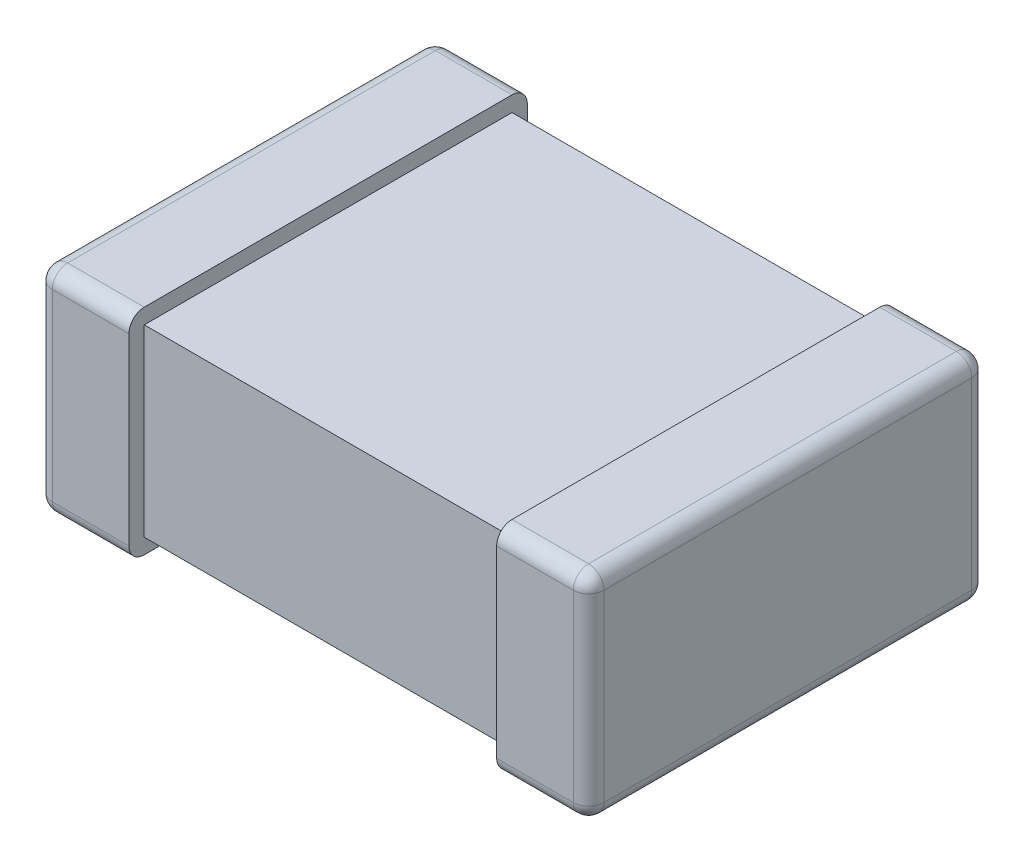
ISO-10303-21;
HEADER;
FILE_DESCRIPTION(('STEP AP214'),'2;1');
FILE_NAME('part.step','',(''),(''),'','','');
FILE_SCHEMA(('AUTOMOTIVE_DESIGN { 1 0 10303 214 1 1 1 1 }'));
ENDSEC;
DATA;
#1=APPLICATION_CONTEXT('core data for automotive mechanical design processes');
#2=APPLICATION_PROTOCOL_DEFINITION('international standard','automotive_design',2000,#1);
#3=PRODUCT_CONTEXT('',#1,'mechanical');
#4=PRODUCT('Part','Part','',(#3));
#5=PRODUCT_RELATED_PRODUCT_CATEGORY('part','',(#4));
#6=PRODUCT_DEFINITION_FORMATION('','',#4);
#7=PRODUCT_DEFINITION_CONTEXT('part definition',#1,'design');
#8=PRODUCT_DEFINITION('design','',#6,#7);
#9=PRODUCT_DEFINITION_SHAPE('','',#8);
#10=(LENGTH_UNIT() NAMED_UNIT(*) SI_UNIT(.MILLI.,.METRE.));
#11=(NAMED_UNIT(*) PLANE_ANGLE_UNIT() SI_UNIT($,.RADIAN.));
#12=(NAMED_UNIT(*) SI_UNIT($,.STERADIAN.) SOLID_ANGLE_UNIT());
#13=UNCERTAINTY_MEASURE_WITH_UNIT(LENGTH_MEASURE(1.E-05),#10,'distance_accuracy_value','');
#14=(GEOMETRIC_REPRESENTATION_CONTEXT(3) GLOBAL_UNCERTAINTY_ASSIGNED_CONTEXT((#13)) GLOBAL_UNIT_ASSIGNED_CONTEXT((#10,
#11,#12)) REPRESENTATION_CONTEXT('',''));
#15=CARTESIAN_POINT('',(0.,0.,0.));
#16=DIRECTION('',(0.,0.,1.));
#17=DIRECTION('',(1.,0.,0.));
#18=AXIS2_PLACEMENT_3D('',#15,#16,#17);
#19=CARTESIAN_POINT('',(-1.524,1.524,-1.524));
#20=DIRECTION('',(0.,0.,1.));
#21=DIRECTION('',(1.,0.,0.));
#22=AXIS2_PLACEMENT_3D('',#19,#20,#21);
#23=PLANE('',#22);
#24=DIRECTION('',(-1.,0.,0.));
#25=VECTOR('',#24,1.);
#26=CARTESIAN_POINT('',(-1.524,0.,-1.524));
#27=LINE('',#26,#25);
#28=CARTESIAN_POINT('',(1.524,0.,-1.524));
#29=VERTEX_POINT('',#28);
#30=CARTESIAN_POINT('',(-1.524,0.,-1.524));
#31=VERTEX_POINT('',#30);
#32=EDGE_CURVE('E199',#29,#31,#27,.T.);
#33=ORIENTED_EDGE('',*,*,#32,.T.);
#34=DIRECTION('',(0.,-1.,0.));
#35=VECTOR('',#34,1.);
#36=CARTESIAN_POINT('',(-1.524,1.524,-1.524));
#37=LINE('',#36,#35);
#38=CARTESIAN_POINT('',(-1.524,1.524,-1.524));
#39=VERTEX_POINT('',#38);
#40=EDGE_CURVE('E222',#39,#31,#37,.T.);
#41=ORIENTED_EDGE('',*,*,#40,.F.);
#42=DIRECTION('',(-1.,0.,0.));
#43=VECTOR('',#42,1.);
#44=CARTESIAN_POINT('',(-1.524,1.524,-1.524));
#45=LINE('',#44,#43);
#46=CARTESIAN_POINT('',(1.524,1.524,-1.524));
#47=VERTEX_POINT('',#46);
#48=EDGE_CURVE('E435',#47,#39,#45,.T.);
#49=ORIENTED_EDGE('',*,*,#48,.F.);
#50=DIRECTION('',(0.,-1.,0.));
#51=VECTOR('',#50,1.);
#52=CARTESIAN_POINT('',(1.524,1.524,-1.524));
#53=LINE('',#52,#51);
#54=EDGE_CURVE('E230',#47,#29,#53,.T.);
#55=ORIENTED_EDGE('',*,*,#54,.T.);
#56=EDGE_LOOP('',(#33,#41,#49,#55));
#57=FACE_BOUND('',#56,.T.);
#58=ADVANCED_FACE('F32',(#57),#23,.F.);
#59=CARTESIAN_POINT('',(-1.524,1.524,1.524));
#60=DIRECTION('',(0.,0.,-1.));
#61=DIRECTION('',(-1.,0.,0.));
#62=AXIS2_PLACEMENT_3D('',#59,#60,#61);
#63=PLANE('',#62);
#64=DIRECTION('',(1.,0.,0.));
#65=VECTOR('',#64,1.);
#66=CARTESIAN_POINT('',(-1.524,0.,1.524));
#67=LINE('',#66,#65);
#68=CARTESIAN_POINT('',(-1.524,0.,1.524));
#69=VERTEX_POINT('',#68);
#70=CARTESIAN_POINT('',(1.524,0.,1.524));
#71=VERTEX_POINT('',#70);
#72=EDGE_CURVE('E196',#69,#71,#67,.T.);
#73=ORIENTED_EDGE('',*,*,#72,.T.);
#74=DIRECTION('',(0.,-1.,0.));
#75=VECTOR('',#74,1.);
#76=CARTESIAN_POINT('',(1.524,1.524,1.524));
#77=LINE('',#76,#75);
#78=CARTESIAN_POINT('',(1.524,1.524,1.524));
#79=VERTEX_POINT('',#78);
#80=EDGE_CURVE('E210',#79,#71,#77,.T.);
#81=ORIENTED_EDGE('',*,*,#80,.F.);
#82=DIRECTION('',(1.,0.,0.));
#83=VECTOR('',#82,1.);
#84=CARTESIAN_POINT('',(-1.524,1.524,1.524));
#85=LINE('',#84,#83);
#86=CARTESIAN_POINT('',(-1.524,1.524,1.524));
#87=VERTEX_POINT('',#86);
#88=EDGE_CURVE('E220',#87,#79,#85,.T.);
#89=ORIENTED_EDGE('',*,*,#88,.F.);
#90=DIRECTION('',(0.,-1.,0.));
#91=VECTOR('',#90,1.);
#92=CARTESIAN_POINT('',(-1.524,1.524,1.524));
#93=LINE('',#92,#91);
#94=EDGE_CURVE('E213',#87,#69,#93,.T.);
#95=ORIENTED_EDGE('',*,*,#94,.T.);
#96=EDGE_LOOP('',(#73,#81,#89,#95));
#97=FACE_BOUND('',#96,.T.);
#98=ADVANCED_FACE('F208',(#97),#63,.F.);
#99=CARTESIAN_POINT('',(0.,1.524,0.));
#100=DIRECTION('',(0.,-1.,0.));
#101=DIRECTION('',(0.,0.,-1.));
#102=AXIS2_PLACEMENT_3D('',#99,#100,#101);
#103=PLANE('',#102);
#104=DIRECTION('',(0.,0.,-1.));
#105=VECTOR('',#104,1.);
#106=CARTESIAN_POINT('',(1.524,1.524,1.524));
#107=LINE('',#106,#105);
#108=EDGE_CURVE('E214',#79,#47,#107,.T.);
#109=ORIENTED_EDGE('',*,*,#108,.T.);
#110=ORIENTED_EDGE('',*,*,#48,.T.);
#111=DIRECTION('',(0.,0.,1.));
#112=VECTOR('',#111,1.);
#113=CARTESIAN_POINT('',(-1.524,1.524,1.524));
#114=LINE('',#113,#112);
#115=EDGE_CURVE('E224',#39,#87,#114,.T.);
#116=ORIENTED_EDGE('',*,*,#115,.T.);
#117=ORIENTED_EDGE('',*,*,#88,.T.);
#118=EDGE_LOOP('',(#109,#110,#116,#117));
#119=FACE_BOUND('',#118,.T.);
#120=ADVANCED_FACE('F445',(#119),#103,.F.);
#121=CARTESIAN_POINT('',(0.,0.,0.));
#122=DIRECTION('',(0.,-1.,0.));
#123=DIRECTION('',(0.,0.,-1.));
#124=AXIS2_PLACEMENT_3D('',#121,#122,#123);
#125=PLANE('',#124);
#126=DIRECTION('',(0.,0.,-1.));
#127=VECTOR('',#126,1.);
#128=CARTESIAN_POINT('',(1.524,0.,1.524));
#129=LINE('',#128,#127);
#130=EDGE_CURVE('E193',#71,#29,#129,.T.);
#131=ORIENTED_EDGE('',*,*,#130,.F.);
#132=ORIENTED_EDGE('',*,*,#72,.F.);
#133=DIRECTION('',(0.,0.,1.));
#134=VECTOR('',#133,1.);
#135=CARTESIAN_POINT('',(-1.524,0.,1.524));
#136=LINE('',#135,#134);
#137=EDGE_CURVE('E215',#31,#69,#136,.T.);
#138=ORIENTED_EDGE('',*,*,#137,.F.);
#139=ORIENTED_EDGE('',*,*,#32,.F.);
#140=EDGE_LOOP('',(#131,#132,#138,#139));
#141=FACE_BOUND('',#140,.T.);
#142=ADVANCED_FACE('F195',(#141),#125,.T.);
#143=CARTESIAN_POINT('',(-2.286,-0.127,1.651));
#144=DIRECTION('',(0.,0.,-1.));
#145=DIRECTION('',(-1.,0.,0.));
#146=AXIS2_PLACEMENT_3D('',#143,#144,#145);
#147=PLANE('',#146);
#148=DIRECTION('',(0.,1.,0.));
#149=VECTOR('',#148,1.);
#150=CARTESIAN_POINT('',(-2.159,-0.127,1.651));
#151=LINE('',#150,#149);
#152=CARTESIAN_POINT('',(-2.159,1.524,1.651));
#153=VERTEX_POINT('',#152);
#154=CARTESIAN_POINT('',(-2.159,0.,1.651));
#155=VERTEX_POINT('',#154);
#156=EDGE_CURVE('E256',#153,#155,#151,.F.);
#157=ORIENTED_EDGE('',*,*,#156,.T.);
#158=DIRECTION('',(1.,0.,0.));
#159=VECTOR('',#158,1.);
#160=CARTESIAN_POINT('',(-2.286,0.,1.651));
#161=LINE('',#160,#159);
#162=CARTESIAN_POINT('',(-1.524,0.,1.651));
#163=VERTEX_POINT('',#162);
#164=EDGE_CURVE('E258',#155,#163,#161,.T.);
#165=ORIENTED_EDGE('',*,*,#164,.T.);
#166=DIRECTION('',(0.,1.,0.));
#167=VECTOR('',#166,1.);
#168=CARTESIAN_POINT('',(-1.524,-0.127,1.651));
#169=LINE('',#168,#167);
#170=CARTESIAN_POINT('',(-1.524,1.524,1.651));
#171=VERTEX_POINT('',#170);
#172=EDGE_CURVE('E416',#163,#171,#169,.T.);
#173=ORIENTED_EDGE('',*,*,#172,.T.);
#174=DIRECTION('',(1.,0.,0.));
#175=VECTOR('',#174,1.);
#176=CARTESIAN_POINT('',(-2.286,1.524,1.651));
#177=LINE('',#176,#175);
#178=EDGE_CURVE('E254',#171,#153,#177,.F.);
#179=ORIENTED_EDGE('',*,*,#178,.T.);
#180=EDGE_LOOP('',(#157,#165,#173,#179));
#181=FACE_BOUND('',#180,.T.);
#182=ADVANCED_FACE('F452',(#181),#147,.F.);
#183=CARTESIAN_POINT('',(-2.286,1.651,-1.651));
#184=DIRECTION('',(0.,-1.,0.));
#185=DIRECTION('',(0.,0.,-1.));
#186=AXIS2_PLACEMENT_3D('',#183,#184,#185);
#187=PLANE('',#186);
#188=DIRECTION('',(0.,0.,-1.));
#189=VECTOR('',#188,1.);
#190=CARTESIAN_POINT('',(-1.524,1.651,-1.651));
#191=LINE('',#190,#189);
#192=CARTESIAN_POINT('',(-1.524,1.651,1.524));
#193=VERTEX_POINT('',#192);
#194=CARTESIAN_POINT('',(-1.524,1.651,-1.524));
#195=VERTEX_POINT('',#194);
#196=EDGE_CURVE('E420',#193,#195,#191,.T.);
#197=ORIENTED_EDGE('',*,*,#196,.T.);
#198=DIRECTION('',(1.,0.,0.));
#199=VECTOR('',#198,1.);
#200=CARTESIAN_POINT('',(-2.286,1.651,-1.524));
#201=LINE('',#200,#199);
#202=CARTESIAN_POINT('',(-2.159,1.651,-1.524));
#203=VERTEX_POINT('',#202);
#204=EDGE_CURVE('E252',#195,#203,#201,.F.);
#205=ORIENTED_EDGE('',*,*,#204,.T.);
#206=DIRECTION('',(0.,0.,-1.));
#207=VECTOR('',#206,1.);
#208=CARTESIAN_POINT('',(-2.159,1.651,-1.651));
#209=LINE('',#208,#207);
#210=CARTESIAN_POINT('',(-2.159,1.651,1.524));
#211=VERTEX_POINT('',#210);
#212=EDGE_CURVE('E250',#203,#211,#209,.F.);
#213=ORIENTED_EDGE('',*,*,#212,.T.);
#214=DIRECTION('',(1.,0.,0.));
#215=VECTOR('',#214,1.);
#216=CARTESIAN_POINT('',(-2.286,1.651,1.524));
#217=LINE('',#216,#215);
#218=EDGE_CURVE('E248',#211,#193,#217,.T.);
#219=ORIENTED_EDGE('',*,*,#218,.T.);
#220=EDGE_LOOP('',(#197,#205,#213,#219));
#221=FACE_BOUND('',#220,.T.);
#222=ADVANCED_FACE('F588',(#221),#187,.F.);
#223=CARTESIAN_POINT('',(-2.286,-0.127,-1.651));
#224=DIRECTION('',(0.,0.,1.));
#225=DIRECTION('',(1.,0.,0.));
#226=AXIS2_PLACEMENT_3D('',#223,#224,#225);
#227=PLANE('',#226);
#228=DIRECTION('',(0.,-1.,0.));
#229=VECTOR('',#228,1.);
#230=CARTESIAN_POINT('',(-1.524,-0.127,-1.651));
#231=LINE('',#230,#229);
#232=CARTESIAN_POINT('',(-1.524,1.524,-1.651));
#233=VERTEX_POINT('',#232);
#234=CARTESIAN_POINT('',(-1.524,0.,-1.651));
#235=VERTEX_POINT('',#234);
#236=EDGE_CURVE('E429',#233,#235,#231,.T.);
#237=ORIENTED_EDGE('',*,*,#236,.T.);
#238=DIRECTION('',(1.,0.,0.));
#239=VECTOR('',#238,1.);
#240=CARTESIAN_POINT('',(-2.286,0.,-1.651));
#241=LINE('',#240,#239);
#242=CARTESIAN_POINT('',(-2.159,0.,-1.651));
#243=VERTEX_POINT('',#242);
#244=EDGE_CURVE('E264',#235,#243,#241,.F.);
#245=ORIENTED_EDGE('',*,*,#244,.T.);
#246=DIRECTION('',(0.,-1.,0.));
#247=VECTOR('',#246,1.);
#248=CARTESIAN_POINT('',(-2.159,-0.127,-1.651));
#249=LINE('',#248,#247);
#250=CARTESIAN_POINT('',(-2.159,1.524,-1.651));
#251=VERTEX_POINT('',#250);
#252=EDGE_CURVE('E262',#243,#251,#249,.F.);
#253=ORIENTED_EDGE('',*,*,#252,.T.);
#254=DIRECTION('',(1.,0.,0.));
#255=VECTOR('',#254,1.);
#256=CARTESIAN_POINT('',(-2.286,1.524,-1.651));
#257=LINE('',#256,#255);
#258=EDGE_CURVE('E260',#251,#233,#257,.T.);
#259=ORIENTED_EDGE('',*,*,#258,.T.);
#260=EDGE_LOOP('',(#237,#245,#253,#259));
#261=FACE_BOUND('',#260,.T.);
#262=ADVANCED_FACE('F584',(#261),#227,.F.);
#263=CARTESIAN_POINT('',(-2.286,-0.127,-1.651));
#264=DIRECTION('',(0.,1.,0.));
#265=DIRECTION('',(0.,0.,1.));
#266=AXIS2_PLACEMENT_3D('',#263,#264,#265);
#267=PLANE('',#266);
#268=DIRECTION('',(0.,0.,1.));
#269=VECTOR('',#268,1.);
#270=CARTESIAN_POINT('',(-2.159,-0.127,-1.651));
#271=LINE('',#270,#269);
#272=CARTESIAN_POINT('',(-2.159,-0.127,1.524));
#273=VERTEX_POINT('',#272);
#274=CARTESIAN_POINT('',(-2.159,-0.127,-1.524));
#275=VERTEX_POINT('',#274);
#276=EDGE_CURVE('E243',#273,#275,#271,.F.);
#277=ORIENTED_EDGE('',*,*,#276,.T.);
#278=DIRECTION('',(1.,0.,0.));
#279=VECTOR('',#278,1.);
#280=CARTESIAN_POINT('',(-2.286,-0.127,-1.524));
#281=LINE('',#280,#279);
#282=CARTESIAN_POINT('',(-1.524,-0.127,-1.524));
#283=VERTEX_POINT('',#282);
#284=EDGE_CURVE('E246',#275,#283,#281,.T.);
#285=ORIENTED_EDGE('',*,*,#284,.T.);
#286=DIRECTION('',(0.,0.,1.));
#287=VECTOR('',#286,1.);
#288=CARTESIAN_POINT('',(-1.524,-0.127,-1.651));
#289=LINE('',#288,#287);
#290=CARTESIAN_POINT('',(-1.524,-0.127,1.524));
#291=VERTEX_POINT('',#290);
#292=EDGE_CURVE('E204',#283,#291,#289,.T.);
#293=ORIENTED_EDGE('',*,*,#292,.T.);
#294=DIRECTION('',(1.,0.,0.));
#295=VECTOR('',#294,1.);
#296=CARTESIAN_POINT('',(-2.286,-0.127,1.524));
#297=LINE('',#296,#295);
#298=EDGE_CURVE('E241',#291,#273,#297,.F.);
#299=ORIENTED_EDGE('',*,*,#298,.T.);
#300=EDGE_LOOP('',(#277,#285,#293,#299));
#301=FACE_BOUND('',#300,.T.);
#302=ADVANCED_FACE('F578',(#301),#267,.F.);
#303=CARTESIAN_POINT('',(-2.286,0.,0.));
#304=DIRECTION('',(1.,0.,0.));
#305=DIRECTION('',(0.,0.,-1.));
#306=AXIS2_PLACEMENT_3D('',#303,#304,#305);
#307=PLANE('',#306);
#308=DIRECTION('',(0.,0.,1.));
#309=VECTOR('',#308,1.);
#310=CARTESIAN_POINT('',(-2.286,0.,0.));
#311=LINE('',#310,#309);
#312=CARTESIAN_POINT('',(-2.286,0.,-1.524));
#313=VERTEX_POINT('',#312);
#314=CARTESIAN_POINT('',(-2.286,0.,1.524));
#315=VERTEX_POINT('',#314);
#316=EDGE_CURVE('E236',#313,#315,#311,.T.);
#317=ORIENTED_EDGE('',*,*,#316,.T.);
#318=DIRECTION('',(0.,1.,0.));
#319=VECTOR('',#318,1.);
#320=CARTESIAN_POINT('',(-2.286,0.,1.524));
#321=LINE('',#320,#319);
#322=CARTESIAN_POINT('',(-2.286,1.524,1.524));
#323=VERTEX_POINT('',#322);
#324=EDGE_CURVE('E239',#315,#323,#321,.T.);
#325=ORIENTED_EDGE('',*,*,#324,.T.);
#326=DIRECTION('',(0.,0.,-1.));
#327=VECTOR('',#326,1.);
#328=CARTESIAN_POINT('',(-2.286,1.524,0.));
#329=LINE('',#328,#327);
#330=CARTESIAN_POINT('',(-2.286,1.524,-1.524));
#331=VERTEX_POINT('',#330);
#332=EDGE_CURVE('E234',#323,#331,#329,.T.);
#333=ORIENTED_EDGE('',*,*,#332,.T.);
#334=DIRECTION('',(0.,-1.,0.));
#335=VECTOR('',#334,1.);
#336=CARTESIAN_POINT('',(-2.286,0.,-1.524));
#337=LINE('',#336,#335);
#338=EDGE_CURVE('E232',#331,#313,#337,.T.);
#339=ORIENTED_EDGE('',*,*,#338,.T.);
#340=EDGE_LOOP('',(#317,#325,#333,#339));
#341=FACE_BOUND('',#340,.T.);
#342=ADVANCED_FACE('F575',(#341),#307,.F.);
#343=CARTESIAN_POINT('',(-1.524,0.,0.));
#344=DIRECTION('',(1.,0.,0.));
#345=DIRECTION('',(0.,0.,-1.));
#346=AXIS2_PLACEMENT_3D('',#343,#344,#345);
#347=PLANE('',#346);
#348=ORIENTED_EDGE('',*,*,#40,.T.);
#349=ORIENTED_EDGE('',*,*,#137,.T.);
#350=ORIENTED_EDGE('',*,*,#94,.F.);
#351=ORIENTED_EDGE('',*,*,#115,.F.);
#352=EDGE_LOOP('',(#348,#349,#350,#351));
#353=FACE_BOUND('',#352,.T.);
#354=ORIENTED_EDGE('',*,*,#292,.F.);
#355=CARTESIAN_POINT('',(-1.524,0.,-1.524));
#356=DIRECTION('',(1.,0.,0.));
#357=DIRECTION('',(0.,0.,-1.));
#358=AXIS2_PLACEMENT_3D('',#355,#356,#357);
#359=CIRCLE('',#358,0.127);
#360=EDGE_CURVE('E11',#283,#235,#359,.T.);
#361=ORIENTED_EDGE('',*,*,#360,.T.);
#362=ORIENTED_EDGE('',*,*,#236,.F.);
#363=CARTESIAN_POINT('',(-1.524,1.524,-1.524));
#364=DIRECTION('',(1.,0.,0.));
#365=DIRECTION('',(0.,0.,-1.));
#366=AXIS2_PLACEMENT_3D('',#363,#364,#365);
#367=CIRCLE('',#366,0.127);
#368=EDGE_CURVE('E41',#233,#195,#367,.T.);
#369=ORIENTED_EDGE('',*,*,#368,.T.);
#370=ORIENTED_EDGE('',*,*,#196,.F.);
#371=CARTESIAN_POINT('',(-1.524,1.524,1.524));
#372=DIRECTION('',(1.,0.,0.));
#373=DIRECTION('',(0.,0.,-1.));
#374=AXIS2_PLACEMENT_3D('',#371,#372,#373);
#375=CIRCLE('',#374,0.127);
#376=EDGE_CURVE('E306',#193,#171,#375,.T.);
#377=ORIENTED_EDGE('',*,*,#376,.T.);
#378=ORIENTED_EDGE('',*,*,#172,.F.);
#379=CARTESIAN_POINT('',(-1.524,0.,1.524));
#380=DIRECTION('',(1.,0.,0.));
#381=DIRECTION('',(0.,0.,-1.));
#382=AXIS2_PLACEMENT_3D('',#379,#380,#381);
#383=CIRCLE('',#382,0.127);
#384=EDGE_CURVE('E308',#163,#291,#383,.T.);
#385=ORIENTED_EDGE('',*,*,#384,.T.);
#386=EDGE_LOOP('',(#354,#361,#362,#369,#370,#377,#378,#385));
#387=FACE_BOUND('',#386,.T.);
#388=ADVANCED_FACE('F439',(#353,#387),#347,.T.);
#389=CARTESIAN_POINT('',(2.286,-0.127,-1.651));
#390=DIRECTION('',(0.,0.,1.));
#391=DIRECTION('',(1.,0.,0.));
#392=AXIS2_PLACEMENT_3D('',#389,#390,#391);
#393=PLANE('',#392);
#394=DIRECTION('',(0.,1.,0.));
#395=VECTOR('',#394,1.);
#396=CARTESIAN_POINT('',(2.159,-0.127,-1.651));
#397=LINE('',#396,#395);
#398=CARTESIAN_POINT('',(2.159,1.524,-1.651));
#399=VERTEX_POINT('',#398);
#400=CARTESIAN_POINT('',(2.159,0.,-1.651));
#401=VERTEX_POINT('',#400);
#402=EDGE_CURVE('E290',#399,#401,#397,.F.);
#403=ORIENTED_EDGE('',*,*,#402,.T.);
#404=DIRECTION('',(-1.,0.,0.));
#405=VECTOR('',#404,1.);
#406=CARTESIAN_POINT('',(2.286,0.,-1.651));
#407=LINE('',#406,#405);
#408=CARTESIAN_POINT('',(1.524,0.,-1.651));
#409=VERTEX_POINT('',#408);
#410=EDGE_CURVE('E292',#401,#409,#407,.T.);
#411=ORIENTED_EDGE('',*,*,#410,.T.);
#412=DIRECTION('',(0.,1.,0.));
#413=VECTOR('',#412,1.);
#414=CARTESIAN_POINT('',(1.524,-0.127,-1.651));
#415=LINE('',#414,#413);
#416=CARTESIAN_POINT('',(1.524,1.524,-1.651));
#417=VERTEX_POINT('',#416);
#418=EDGE_CURVE('E345',#409,#417,#415,.T.);
#419=ORIENTED_EDGE('',*,*,#418,.T.);
#420=DIRECTION('',(-1.,0.,0.));
#421=VECTOR('',#420,1.);
#422=CARTESIAN_POINT('',(2.286,1.524,-1.651));
#423=LINE('',#422,#421);
#424=EDGE_CURVE('E288',#417,#399,#423,.F.);
#425=ORIENTED_EDGE('',*,*,#424,.T.);
#426=EDGE_LOOP('',(#403,#411,#419,#425));
#427=FACE_BOUND('',#426,.T.);
#428=ADVANCED_FACE('F400',(#427),#393,.F.);
#429=CARTESIAN_POINT('',(2.286,1.651,1.651));
#430=DIRECTION('',(0.,-1.,0.));
#431=DIRECTION('',(0.,0.,-1.));
#432=AXIS2_PLACEMENT_3D('',#429,#430,#431);
#433=PLANE('',#432);
#434=DIRECTION('',(0.,0.,1.));
#435=VECTOR('',#434,1.);
#436=CARTESIAN_POINT('',(2.159,1.651,1.651));
#437=LINE('',#436,#435);
#438=CARTESIAN_POINT('',(2.159,1.651,1.524));
#439=VERTEX_POINT('',#438);
#440=CARTESIAN_POINT('',(2.159,1.651,-1.524));
#441=VERTEX_POINT('',#440);
#442=EDGE_CURVE('E49',#439,#441,#437,.F.);
#443=ORIENTED_EDGE('',*,*,#442,.T.);
#444=DIRECTION('',(-1.,0.,0.));
#445=VECTOR('',#444,1.);
#446=CARTESIAN_POINT('',(2.286,1.651,-1.524));
#447=LINE('',#446,#445);
#448=CARTESIAN_POINT('',(1.524,1.651,-1.524));
#449=VERTEX_POINT('',#448);
#450=EDGE_CURVE('E296',#441,#449,#447,.T.);
#451=ORIENTED_EDGE('',*,*,#450,.T.);
#452=DIRECTION('',(0.,0.,1.));
#453=VECTOR('',#452,1.);
#454=CARTESIAN_POINT('',(1.524,1.651,1.651));
#455=LINE('',#454,#453);
#456=CARTESIAN_POINT('',(1.524,1.651,1.524));
#457=VERTEX_POINT('',#456);
#458=EDGE_CURVE('E423',#449,#457,#455,.T.);
#459=ORIENTED_EDGE('',*,*,#458,.T.);
#460=DIRECTION('',(-1.,0.,0.));
#461=VECTOR('',#460,1.);
#462=CARTESIAN_POINT('',(2.286,1.651,1.524));
#463=LINE('',#462,#461);
#464=EDGE_CURVE('E54',#457,#439,#463,.F.);
#465=ORIENTED_EDGE('',*,*,#464,.T.);
#466=EDGE_LOOP('',(#443,#451,#459,#465));
#467=FACE_BOUND('',#466,.T.);
#468=ADVANCED_FACE('F551',(#467),#433,.F.);
#469=CARTESIAN_POINT('',(2.286,-0.127,1.651));
#470=DIRECTION('',(0.,0.,-1.));
#471=DIRECTION('',(-1.,0.,0.));
#472=AXIS2_PLACEMENT_3D('',#469,#470,#471);
#473=PLANE('',#472);
#474=DIRECTION('',(0.,-1.,0.));
#475=VECTOR('',#474,1.);
#476=CARTESIAN_POINT('',(1.524,-0.127,1.651));
#477=LINE('',#476,#475);
#478=CARTESIAN_POINT('',(1.524,1.524,1.651));
#479=VERTEX_POINT('',#478);
#480=CARTESIAN_POINT('',(1.524,0.,1.651));
#481=VERTEX_POINT('',#480);
#482=EDGE_CURVE('E417',#479,#481,#477,.T.);
#483=ORIENTED_EDGE('',*,*,#482,.T.);
#484=DIRECTION('',(-1.,0.,0.));
#485=VECTOR('',#484,1.);
#486=CARTESIAN_POINT('',(2.286,0.,1.651));
#487=LINE('',#486,#485);
#488=CARTESIAN_POINT('',(2.159,0.,1.651));
#489=VERTEX_POINT('',#488);
#490=EDGE_CURVE('E280',#481,#489,#487,.F.);
#491=ORIENTED_EDGE('',*,*,#490,.T.);
#492=DIRECTION('',(0.,-1.,0.));
#493=VECTOR('',#492,1.);
#494=CARTESIAN_POINT('',(2.159,-0.127,1.651));
#495=LINE('',#494,#493);
#496=CARTESIAN_POINT('',(2.159,1.524,1.651));
#497=VERTEX_POINT('',#496);
#498=EDGE_CURVE('E277',#489,#497,#495,.F.);
#499=ORIENTED_EDGE('',*,*,#498,.T.);
#500=DIRECTION('',(-1.,0.,0.));
#501=VECTOR('',#500,1.);
#502=CARTESIAN_POINT('',(2.286,1.524,1.651));
#503=LINE('',#502,#501);
#504=EDGE_CURVE('E275',#497,#479,#503,.T.);
#505=ORIENTED_EDGE('',*,*,#504,.T.);
#506=EDGE_LOOP('',(#483,#491,#499,#505));
#507=FACE_BOUND('',#506,.T.);
#508=ADVANCED_FACE('F562',(#507),#473,.F.);
#509=CARTESIAN_POINT('',(2.286,-0.127,1.651));
#510=DIRECTION('',(0.,1.,0.));
#511=DIRECTION('',(0.,0.,1.));
#512=AXIS2_PLACEMENT_3D('',#509,#510,#511);
#513=PLANE('',#512);
#514=DIRECTION('',(0.,0.,-1.));
#515=VECTOR('',#514,1.);
#516=CARTESIAN_POINT('',(1.524,-0.127,1.651));
#517=LINE('',#516,#515);
#518=CARTESIAN_POINT('',(1.524,-0.127,1.524));
#519=VERTEX_POINT('',#518);
#520=CARTESIAN_POINT('',(1.524,-0.127,-1.524));
#521=VERTEX_POINT('',#520);
#522=EDGE_CURVE('E411',#519,#521,#517,.T.);
#523=ORIENTED_EDGE('',*,*,#522,.T.);
#524=DIRECTION('',(-1.,0.,0.));
#525=VECTOR('',#524,1.);
#526=CARTESIAN_POINT('',(2.286,-0.127,-1.524));
#527=LINE('',#526,#525);
#528=CARTESIAN_POINT('',(2.159,-0.127,-1.524));
#529=VERTEX_POINT('',#528);
#530=EDGE_CURVE('E286',#521,#529,#527,.F.);
#531=ORIENTED_EDGE('',*,*,#530,.T.);
#532=DIRECTION('',(0.,0.,-1.));
#533=VECTOR('',#532,1.);
#534=CARTESIAN_POINT('',(2.159,-0.127,1.651));
#535=LINE('',#534,#533);
#536=CARTESIAN_POINT('',(2.159,-0.127,1.524));
#537=VERTEX_POINT('',#536);
#538=EDGE_CURVE('E284',#529,#537,#535,.F.);
#539=ORIENTED_EDGE('',*,*,#538,.T.);
#540=DIRECTION('',(-1.,0.,0.));
#541=VECTOR('',#540,1.);
#542=CARTESIAN_POINT('',(2.286,-0.127,1.524));
#543=LINE('',#542,#541);
#544=EDGE_CURVE('E282',#537,#519,#543,.T.);
#545=ORIENTED_EDGE('',*,*,#544,.T.);
#546=EDGE_LOOP('',(#523,#531,#539,#545));
#547=FACE_BOUND('',#546,.T.);
#548=ADVANCED_FACE('F414',(#547),#513,.F.);
#549=CARTESIAN_POINT('',(2.286,0.,0.));
#550=DIRECTION('',(-1.,0.,0.));
#551=DIRECTION('',(0.,0.,1.));
#552=AXIS2_PLACEMENT_3D('',#549,#550,#551);
#553=PLANE('',#552);
#554=DIRECTION('',(0.,0.,1.));
#555=VECTOR('',#554,1.);
#556=CARTESIAN_POINT('',(2.286,1.524,0.));
#557=LINE('',#556,#555);
#558=CARTESIAN_POINT('',(2.286,1.524,-1.524));
#559=VERTEX_POINT('',#558);
#560=CARTESIAN_POINT('',(2.286,1.524,1.524));
#561=VERTEX_POINT('',#560);
#562=EDGE_CURVE('E266',#559,#561,#557,.T.);
#563=ORIENTED_EDGE('',*,*,#562,.T.);
#564=DIRECTION('',(0.,-1.,0.));
#565=VECTOR('',#564,1.);
#566=CARTESIAN_POINT('',(2.286,0.,1.524));
#567=LINE('',#566,#565);
#568=CARTESIAN_POINT('',(2.286,0.,1.524));
#569=VERTEX_POINT('',#568);
#570=EDGE_CURVE('E272',#561,#569,#567,.T.);
#571=ORIENTED_EDGE('',*,*,#570,.T.);
#572=DIRECTION('',(0.,0.,-1.));
#573=VECTOR('',#572,1.);
#574=CARTESIAN_POINT('',(2.286,0.,0.));
#575=LINE('',#574,#573);
#576=CARTESIAN_POINT('',(2.286,0.,-1.524));
#577=VERTEX_POINT('',#576);
#578=EDGE_CURVE('E270',#569,#577,#575,.T.);
#579=ORIENTED_EDGE('',*,*,#578,.T.);
#580=DIRECTION('',(0.,1.,0.));
#581=VECTOR('',#580,1.);
#582=CARTESIAN_POINT('',(2.286,0.,-1.524));
#583=LINE('',#582,#581);
#584=EDGE_CURVE('E268',#577,#559,#583,.T.);
#585=ORIENTED_EDGE('',*,*,#584,.T.);
#586=EDGE_LOOP('',(#563,#571,#579,#585));
#587=FACE_BOUND('',#586,.T.);
#588=ADVANCED_FACE('F390',(#587),#553,.F.);
#589=CARTESIAN_POINT('',(1.524,0.,0.));
#590=DIRECTION('',(-1.,0.,0.));
#591=DIRECTION('',(0.,0.,1.));
#592=AXIS2_PLACEMENT_3D('',#589,#590,#591);
#593=PLANE('',#592);
#594=ORIENTED_EDGE('',*,*,#80,.T.);
#595=ORIENTED_EDGE('',*,*,#130,.T.);
#596=ORIENTED_EDGE('',*,*,#54,.F.);
#597=ORIENTED_EDGE('',*,*,#108,.F.);
#598=EDGE_LOOP('',(#594,#595,#596,#597));
#599=FACE_BOUND('',#598,.T.);
#600=ORIENTED_EDGE('',*,*,#418,.F.);
#601=CARTESIAN_POINT('',(1.524,0.,-1.524));
#602=DIRECTION('',(-1.,0.,0.));
#603=DIRECTION('',(0.,0.,1.));
#604=AXIS2_PLACEMENT_3D('',#601,#602,#603);
#605=CIRCLE('',#604,0.127);
#606=EDGE_CURVE('E304',#409,#521,#605,.T.);
#607=ORIENTED_EDGE('',*,*,#606,.T.);
#608=ORIENTED_EDGE('',*,*,#522,.F.);
#609=CARTESIAN_POINT('',(1.524,0.,1.524));
#610=DIRECTION('',(-1.,0.,0.));
#611=DIRECTION('',(0.,0.,1.));
#612=AXIS2_PLACEMENT_3D('',#609,#610,#611);
#613=CIRCLE('',#612,0.127);
#614=EDGE_CURVE('E300',#519,#481,#613,.T.);
#615=ORIENTED_EDGE('',*,*,#614,.T.);
#616=ORIENTED_EDGE('',*,*,#482,.F.);
#617=CARTESIAN_POINT('',(1.524,1.524,1.524));
#618=DIRECTION('',(-1.,0.,0.));
#619=DIRECTION('',(0.,0.,1.));
#620=AXIS2_PLACEMENT_3D('',#617,#618,#619);
#621=CIRCLE('',#620,0.127);
#622=EDGE_CURVE('E298',#479,#457,#621,.T.);
#623=ORIENTED_EDGE('',*,*,#622,.T.);
#624=ORIENTED_EDGE('',*,*,#458,.F.);
#625=CARTESIAN_POINT('',(1.524,1.524,-1.524));
#626=DIRECTION('',(-1.,0.,0.));
#627=DIRECTION('',(0.,0.,1.));
#628=AXIS2_PLACEMENT_3D('',#625,#626,#627);
#629=CIRCLE('',#628,0.127);
#630=EDGE_CURVE('E302',#449,#417,#629,.T.);
#631=ORIENTED_EDGE('',*,*,#630,.T.);
#632=EDGE_LOOP('',(#600,#607,#608,#615,#616,#623,#624,#631));
#633=FACE_BOUND('',#632,.T.);
#634=ADVANCED_FACE('F217',(#599,#633),#593,.T.);
#635=CARTESIAN_POINT('',(-2.286,1.524,-1.524));
#636=DIRECTION('',(1.,0.,0.));
#637=DIRECTION('',(0.,0.,-1.));
#638=AXIS2_PLACEMENT_3D('',#635,#636,#637);
#639=CYLINDRICAL_SURFACE('',#638,0.127);
#640=ORIENTED_EDGE('',*,*,#368,.F.);
#641=ORIENTED_EDGE('',*,*,#258,.F.);
#642=CARTESIAN_POINT('',(-2.159,1.524,-1.524));
#643=DIRECTION('',(-1.,0.,0.));
#644=DIRECTION('',(0.,0.,1.));
#645=AXIS2_PLACEMENT_3D('',#642,#643,#644);
#646=CIRCLE('',#645,0.127);
#647=EDGE_CURVE('E342',#203,#251,#646,.T.);
#648=ORIENTED_EDGE('',*,*,#647,.F.);
#649=ORIENTED_EDGE('',*,*,#204,.F.);
#650=EDGE_LOOP('',(#640,#641,#648,#649));
#651=FACE_BOUND('',#650,.T.);
#652=ADVANCED_FACE('F504',(#651),#639,.T.);
#653=CARTESIAN_POINT('',(-2.159,1.524,0.));
#654=DIRECTION('',(0.,0.,-1.));
#655=DIRECTION('',(-1.,0.,0.));
#656=AXIS2_PLACEMENT_3D('',#653,#654,#655);
#657=CYLINDRICAL_SURFACE('',#656,0.127);
#658=CARTESIAN_POINT('',(-2.159,1.524,1.524));
#659=DIRECTION('',(0.,0.,1.));
#660=DIRECTION('',(1.,0.,0.));
#661=AXIS2_PLACEMENT_3D('',#658,#659,#660);
#662=CIRCLE('',#661,0.127);
#663=EDGE_CURVE('E336',#211,#323,#662,.T.);
#664=ORIENTED_EDGE('',*,*,#663,.F.);
#665=ORIENTED_EDGE('',*,*,#212,.F.);
#666=CARTESIAN_POINT('',(-2.159,1.524,-1.524));
#667=DIRECTION('',(0.,0.,-1.));
#668=DIRECTION('',(-1.,0.,0.));
#669=AXIS2_PLACEMENT_3D('',#666,#667,#668);
#670=CIRCLE('',#669,0.127);
#671=EDGE_CURVE('E339',#331,#203,#670,.T.);
#672=ORIENTED_EDGE('',*,*,#671,.F.);
#673=ORIENTED_EDGE('',*,*,#332,.F.);
#674=EDGE_LOOP('',(#664,#665,#672,#673));
#675=FACE_BOUND('',#674,.T.);
#676=ADVANCED_FACE('F500',(#675),#657,.T.);
#677=CARTESIAN_POINT('',(-2.286,1.524,1.524));
#678=DIRECTION('',(1.,0.,0.));
#679=DIRECTION('',(0.,0.,-1.));
#680=AXIS2_PLACEMENT_3D('',#677,#678,#679);
#681=CYLINDRICAL_SURFACE('',#680,0.127);
#682=ORIENTED_EDGE('',*,*,#376,.F.);
#683=ORIENTED_EDGE('',*,*,#218,.F.);
#684=CARTESIAN_POINT('',(-2.159,1.524,1.524));
#685=DIRECTION('',(-1.,0.,0.));
#686=DIRECTION('',(0.,0.,1.));
#687=AXIS2_PLACEMENT_3D('',#684,#685,#686);
#688=CIRCLE('',#687,0.127);
#689=EDGE_CURVE('E333',#153,#211,#688,.T.);
#690=ORIENTED_EDGE('',*,*,#689,.F.);
#691=ORIENTED_EDGE('',*,*,#178,.F.);
#692=EDGE_LOOP('',(#682,#683,#690,#691));
#693=FACE_BOUND('',#692,.T.);
#694=ADVANCED_FACE('F496',(#693),#681,.T.);
#695=CARTESIAN_POINT('',(-2.159,1.524,-1.524));
#696=DIRECTION('',(0.,0.,1.));
#697=DIRECTION('',(1.,0.,0.));
#698=AXIS2_PLACEMENT_3D('',#695,#696,#697);
#699=SPHERICAL_SURFACE('',#698,0.127);
#700=ORIENTED_EDGE('',*,*,#671,.T.);
#701=ORIENTED_EDGE('',*,*,#647,.T.);
#702=CARTESIAN_POINT('',(-2.159,1.524,-1.524));
#703=DIRECTION('',(0.,1.,0.));
#704=DIRECTION('',(0.,0.,1.));
#705=AXIS2_PLACEMENT_3D('',#702,#703,#704);
#706=CIRCLE('',#705,0.127);
#707=EDGE_CURVE('E330',#331,#251,#706,.F.);
#708=ORIENTED_EDGE('',*,*,#707,.F.);
#709=EDGE_LOOP('',(#700,#701,#708));
#710=FACE_BOUND('',#709,.T.);
#711=ADVANCED_FACE('F492',(#710),#699,.T.);
#712=CARTESIAN_POINT('',(-2.159,1.524,1.524));
#713=DIRECTION('',(0.,0.,1.));
#714=DIRECTION('',(1.,0.,0.));
#715=AXIS2_PLACEMENT_3D('',#712,#713,#714);
#716=SPHERICAL_SURFACE('',#715,0.127);
#717=ORIENTED_EDGE('',*,*,#689,.T.);
#718=ORIENTED_EDGE('',*,*,#663,.T.);
#719=CARTESIAN_POINT('',(-2.159,1.524,1.524));
#720=DIRECTION('',(0.,1.,0.));
#721=DIRECTION('',(0.,0.,1.));
#722=AXIS2_PLACEMENT_3D('',#719,#720,#721);
#723=CIRCLE('',#722,0.127);
#724=EDGE_CURVE('E327',#153,#323,#723,.F.);
#725=ORIENTED_EDGE('',*,*,#724,.F.);
#726=EDGE_LOOP('',(#717,#718,#725));
#727=FACE_BOUND('',#726,.T.);
#728=ADVANCED_FACE('F488',(#727),#716,.T.);
#729=CARTESIAN_POINT('',(-2.286,0.,-1.524));
#730=DIRECTION('',(1.,0.,0.));
#731=DIRECTION('',(0.,0.,-1.));
#732=AXIS2_PLACEMENT_3D('',#729,#730,#731);
#733=CYLINDRICAL_SURFACE('',#732,0.127);
#734=ORIENTED_EDGE('',*,*,#360,.F.);
#735=ORIENTED_EDGE('',*,*,#284,.F.);
#736=CARTESIAN_POINT('',(-2.159,0.,-1.524));
#737=DIRECTION('',(-1.,0.,0.));
#738=DIRECTION('',(0.,0.,1.));
#739=AXIS2_PLACEMENT_3D('',#736,#737,#738);
#740=CIRCLE('',#739,0.127);
#741=EDGE_CURVE('E324',#243,#275,#740,.T.);
#742=ORIENTED_EDGE('',*,*,#741,.F.);
#743=ORIENTED_EDGE('',*,*,#244,.F.);
#744=EDGE_LOOP('',(#734,#735,#742,#743));
#745=FACE_BOUND('',#744,.T.);
#746=ADVANCED_FACE('F484',(#745),#733,.T.);
#747=CARTESIAN_POINT('',(-2.159,0.,-1.524));
#748=DIRECTION('',(0.,-1.,0.));
#749=DIRECTION('',(0.,0.,-1.));
#750=AXIS2_PLACEMENT_3D('',#747,#748,#749);
#751=CYLINDRICAL_SURFACE('',#750,0.127);
#752=ORIENTED_EDGE('',*,*,#707,.T.);
#753=ORIENTED_EDGE('',*,*,#252,.F.);
#754=CARTESIAN_POINT('',(-2.159,0.,-1.524));
#755=DIRECTION('',(0.,-1.,0.));
#756=DIRECTION('',(0.,0.,-1.));
#757=AXIS2_PLACEMENT_3D('',#754,#755,#756);
#758=CIRCLE('',#757,0.127);
#759=EDGE_CURVE('E321',#313,#243,#758,.T.);
#760=ORIENTED_EDGE('',*,*,#759,.F.);
#761=ORIENTED_EDGE('',*,*,#338,.F.);
#762=EDGE_LOOP('',(#752,#753,#760,#761));
#763=FACE_BOUND('',#762,.T.);
#764=ADVANCED_FACE('F480',(#763),#751,.T.);
#765=CARTESIAN_POINT('',(-2.159,0.,1.524));
#766=DIRECTION('',(0.,1.,0.));
#767=DIRECTION('',(0.,0.,1.));
#768=AXIS2_PLACEMENT_3D('',#765,#766,#767);
#769=CYLINDRICAL_SURFACE('',#768,0.127);
#770=ORIENTED_EDGE('',*,*,#724,.T.);
#771=ORIENTED_EDGE('',*,*,#324,.F.);
#772=CARTESIAN_POINT('',(-2.159,0.,1.524));
#773=DIRECTION('',(0.,-1.,0.));
#774=DIRECTION('',(0.,0.,-1.));
#775=AXIS2_PLACEMENT_3D('',#772,#773,#774);
#776=CIRCLE('',#775,0.127);
#777=EDGE_CURVE('E318',#155,#315,#776,.T.);
#778=ORIENTED_EDGE('',*,*,#777,.F.);
#779=ORIENTED_EDGE('',*,*,#156,.F.);
#780=EDGE_LOOP('',(#770,#771,#778,#779));
#781=FACE_BOUND('',#780,.T.);
#782=ADVANCED_FACE('F476',(#781),#769,.T.);
#783=CARTESIAN_POINT('',(-2.286,0.,1.524));
#784=DIRECTION('',(1.,0.,0.));
#785=DIRECTION('',(0.,0.,-1.));
#786=AXIS2_PLACEMENT_3D('',#783,#784,#785);
#787=CYLINDRICAL_SURFACE('',#786,0.127);
#788=ORIENTED_EDGE('',*,*,#384,.F.);
#789=ORIENTED_EDGE('',*,*,#164,.F.);
#790=CARTESIAN_POINT('',(-2.159,0.,1.524));
#791=DIRECTION('',(-1.,0.,0.));
#792=DIRECTION('',(0.,0.,1.));
#793=AXIS2_PLACEMENT_3D('',#790,#791,#792);
#794=CIRCLE('',#793,0.127);
#795=EDGE_CURVE('E315',#273,#155,#794,.T.);
#796=ORIENTED_EDGE('',*,*,#795,.F.);
#797=ORIENTED_EDGE('',*,*,#298,.F.);
#798=EDGE_LOOP('',(#788,#789,#796,#797));
#799=FACE_BOUND('',#798,.T.);
#800=ADVANCED_FACE('F472',(#799),#787,.T.);
#801=CARTESIAN_POINT('',(-2.159,0.,-1.524));
#802=DIRECTION('',(0.,0.,1.));
#803=DIRECTION('',(1.,0.,0.));
#804=AXIS2_PLACEMENT_3D('',#801,#802,#803);
#805=SPHERICAL_SURFACE('',#804,0.127);
#806=ORIENTED_EDGE('',*,*,#759,.T.);
#807=ORIENTED_EDGE('',*,*,#741,.T.);
#808=CARTESIAN_POINT('',(-2.159,0.,-1.524));
#809=DIRECTION('',(0.,0.,-1.));
#810=DIRECTION('',(-1.,0.,0.));
#811=AXIS2_PLACEMENT_3D('',#808,#809,#810);
#812=CIRCLE('',#811,0.127);
#813=EDGE_CURVE('E313',#313,#275,#812,.F.);
#814=ORIENTED_EDGE('',*,*,#813,.F.);
#815=EDGE_LOOP('',(#806,#807,#814));
#816=FACE_BOUND('',#815,.T.);
#817=ADVANCED_FACE('F468',(#816),#805,.T.);
#818=CARTESIAN_POINT('',(-2.159,0.,1.524));
#819=DIRECTION('',(0.,0.,1.));
#820=DIRECTION('',(1.,0.,0.));
#821=AXIS2_PLACEMENT_3D('',#818,#819,#820);
#822=SPHERICAL_SURFACE('',#821,0.127);
#823=ORIENTED_EDGE('',*,*,#795,.T.);
#824=ORIENTED_EDGE('',*,*,#777,.T.);
#825=CARTESIAN_POINT('',(-2.159,0.,1.524));
#826=DIRECTION('',(0.,0.,1.));
#827=DIRECTION('',(1.,0.,0.));
#828=AXIS2_PLACEMENT_3D('',#825,#826,#827);
#829=CIRCLE('',#828,0.127);
#830=EDGE_CURVE('E311',#273,#315,#829,.F.);
#831=ORIENTED_EDGE('',*,*,#830,.F.);
#832=EDGE_LOOP('',(#823,#824,#831));
#833=FACE_BOUND('',#832,.T.);
#834=ADVANCED_FACE('F464',(#833),#822,.T.);
#835=CARTESIAN_POINT('',(-2.159,0.,0.));
#836=DIRECTION('',(0.,0.,1.));
#837=DIRECTION('',(1.,0.,0.));
#838=AXIS2_PLACEMENT_3D('',#835,#836,#837);
#839=CYLINDRICAL_SURFACE('',#838,0.127);
#840=ORIENTED_EDGE('',*,*,#813,.T.);
#841=ORIENTED_EDGE('',*,*,#276,.F.);
#842=ORIENTED_EDGE('',*,*,#830,.T.);
#843=ORIENTED_EDGE('',*,*,#316,.F.);
#844=EDGE_LOOP('',(#840,#841,#842,#843));
#845=FACE_BOUND('',#844,.T.);
#846=ADVANCED_FACE('F461',(#845),#839,.T.);
#847=CARTESIAN_POINT('',(2.286,1.524,-1.524));
#848=DIRECTION('',(-1.,0.,0.));
#849=DIRECTION('',(0.,0.,1.));
#850=AXIS2_PLACEMENT_3D('',#847,#848,#849);
#851=CYLINDRICAL_SURFACE('',#850,0.127);
#852=ORIENTED_EDGE('',*,*,#630,.F.);
#853=ORIENTED_EDGE('',*,*,#450,.F.);
#854=CARTESIAN_POINT('',(2.159,1.524,-1.524));
#855=DIRECTION('',(1.,0.,0.));
#856=DIRECTION('',(0.,0.,-1.));
#857=AXIS2_PLACEMENT_3D('',#854,#855,#856);
#858=CIRCLE('',#857,0.127);
#859=EDGE_CURVE('E36',#399,#441,#858,.T.);
#860=ORIENTED_EDGE('',*,*,#859,.F.);
#861=ORIENTED_EDGE('',*,*,#424,.F.);
#862=EDGE_LOOP('',(#852,#853,#860,#861));
#863=FACE_BOUND('',#862,.T.);
#864=ADVANCED_FACE('F34',(#863),#851,.T.);
#865=CARTESIAN_POINT('',(2.159,0.,-1.524));
#866=DIRECTION('',(0.,1.,0.));
#867=DIRECTION('',(0.,0.,1.));
#868=AXIS2_PLACEMENT_3D('',#865,#866,#867);
#869=CYLINDRICAL_SURFACE('',#868,0.127);
#870=CARTESIAN_POINT('',(2.159,0.,-1.524));
#871=DIRECTION('',(0.,-1.,0.));
#872=DIRECTION('',(0.,0.,-1.));
#873=AXIS2_PLACEMENT_3D('',#870,#871,#872);
#874=CIRCLE('',#873,0.127);
#875=EDGE_CURVE('E371',#401,#577,#874,.T.);
#876=ORIENTED_EDGE('',*,*,#875,.F.);
#877=ORIENTED_EDGE('',*,*,#402,.F.);
#878=CARTESIAN_POINT('',(2.159,1.524,-1.524));
#879=DIRECTION('',(0.,1.,0.));
#880=DIRECTION('',(0.,0.,1.));
#881=AXIS2_PLACEMENT_3D('',#878,#879,#880);
#882=CIRCLE('',#881,0.127);
#883=EDGE_CURVE('E373',#559,#399,#882,.T.);
#884=ORIENTED_EDGE('',*,*,#883,.F.);
#885=ORIENTED_EDGE('',*,*,#584,.F.);
#886=EDGE_LOOP('',(#876,#877,#884,#885));
#887=FACE_BOUND('',#886,.T.);
#888=ADVANCED_FACE('F397',(#887),#869,.T.);
#889=CARTESIAN_POINT('',(2.286,0.,-1.524));
#890=DIRECTION('',(-1.,0.,0.));
#891=DIRECTION('',(0.,0.,1.));
#892=AXIS2_PLACEMENT_3D('',#889,#890,#891);
#893=CYLINDRICAL_SURFACE('',#892,0.127);
#894=ORIENTED_EDGE('',*,*,#606,.F.);
#895=ORIENTED_EDGE('',*,*,#410,.F.);
#896=CARTESIAN_POINT('',(2.159,0.,-1.524));
#897=DIRECTION('',(1.,0.,0.));
#898=DIRECTION('',(0.,0.,-1.));
#899=AXIS2_PLACEMENT_3D('',#896,#897,#898);
#900=CIRCLE('',#899,0.127);
#901=EDGE_CURVE('E368',#529,#401,#900,.T.);
#902=ORIENTED_EDGE('',*,*,#901,.F.);
#903=ORIENTED_EDGE('',*,*,#530,.F.);
#904=EDGE_LOOP('',(#894,#895,#902,#903));
#905=FACE_BOUND('',#904,.T.);
#906=ADVANCED_FACE('F406',(#905),#893,.T.);
#907=CARTESIAN_POINT('',(2.159,1.524,-1.524));
#908=DIRECTION('',(0.,0.,1.));
#909=DIRECTION('',(1.,0.,0.));
#910=AXIS2_PLACEMENT_3D('',#907,#908,#909);
#911=SPHERICAL_SURFACE('',#910,0.127);
#912=ORIENTED_EDGE('',*,*,#883,.T.);
#913=ORIENTED_EDGE('',*,*,#859,.T.);
#914=CARTESIAN_POINT('',(2.159,1.524,-1.524));
#915=DIRECTION('',(0.,0.,-1.));
#916=DIRECTION('',(-1.,0.,0.));
#917=AXIS2_PLACEMENT_3D('',#914,#915,#916);
#918=CIRCLE('',#917,0.127);
#919=EDGE_CURVE('E365',#559,#441,#918,.F.);
#920=ORIENTED_EDGE('',*,*,#919,.F.);
#921=EDGE_LOOP('',(#912,#913,#920));
#922=FACE_BOUND('',#921,.T.);
#923=ADVANCED_FACE('F380',(#922),#911,.T.);
#924=CARTESIAN_POINT('',(2.159,0.,-1.524));
#925=DIRECTION('',(0.,0.,1.));
#926=DIRECTION('',(1.,0.,0.));
#927=AXIS2_PLACEMENT_3D('',#924,#925,#926);
#928=SPHERICAL_SURFACE('',#927,0.127);
#929=ORIENTED_EDGE('',*,*,#901,.T.);
#930=ORIENTED_EDGE('',*,*,#875,.T.);
#931=CARTESIAN_POINT('',(2.159,0.,-1.524));
#932=DIRECTION('',(0.,0.,-1.));
#933=DIRECTION('',(-1.,0.,0.));
#934=AXIS2_PLACEMENT_3D('',#931,#932,#933);
#935=CIRCLE('',#934,0.127);
#936=EDGE_CURVE('E362',#529,#577,#935,.F.);
#937=ORIENTED_EDGE('',*,*,#936,.F.);
#938=EDGE_LOOP('',(#929,#930,#937));
#939=FACE_BOUND('',#938,.T.);
#940=ADVANCED_FACE('F534',(#939),#928,.T.);
#941=CARTESIAN_POINT('',(2.286,1.524,1.524));
#942=DIRECTION('',(-1.,0.,0.));
#943=DIRECTION('',(0.,0.,1.));
#944=AXIS2_PLACEMENT_3D('',#941,#942,#943);
#945=CYLINDRICAL_SURFACE('',#944,0.127);
#946=ORIENTED_EDGE('',*,*,#622,.F.);
#947=ORIENTED_EDGE('',*,*,#504,.F.);
#948=CARTESIAN_POINT('',(2.159,1.524,1.524));
#949=DIRECTION('',(1.,0.,0.));
#950=DIRECTION('',(0.,0.,-1.));
#951=AXIS2_PLACEMENT_3D('',#948,#949,#950);
#952=CIRCLE('',#951,0.127);
#953=EDGE_CURVE('E359',#439,#497,#952,.T.);
#954=ORIENTED_EDGE('',*,*,#953,.F.);
#955=ORIENTED_EDGE('',*,*,#464,.F.);
#956=EDGE_LOOP('',(#946,#947,#954,#955));
#957=FACE_BOUND('',#956,.T.);
#958=ADVANCED_FACE('F531',(#957),#945,.T.);
#959=CARTESIAN_POINT('',(2.159,1.524,0.));
#960=DIRECTION('',(0.,0.,1.));
#961=DIRECTION('',(1.,0.,0.));
#962=AXIS2_PLACEMENT_3D('',#959,#960,#961);
#963=CYLINDRICAL_SURFACE('',#962,0.127);
#964=ORIENTED_EDGE('',*,*,#919,.T.);
#965=ORIENTED_EDGE('',*,*,#442,.F.);
#966=CARTESIAN_POINT('',(2.159,1.524,1.524));
#967=DIRECTION('',(0.,0.,1.));
#968=DIRECTION('',(1.,0.,0.));
#969=AXIS2_PLACEMENT_3D('',#966,#967,#968);
#970=CIRCLE('',#969,0.127);
#971=EDGE_CURVE('E356',#561,#439,#970,.T.);
#972=ORIENTED_EDGE('',*,*,#971,.F.);
#973=ORIENTED_EDGE('',*,*,#562,.F.);
#974=EDGE_LOOP('',(#964,#965,#972,#973));
#975=FACE_BOUND('',#974,.T.);
#976=ADVANCED_FACE('F385',(#975),#963,.T.);
#977=CARTESIAN_POINT('',(2.159,0.,0.));
#978=DIRECTION('',(0.,0.,-1.));
#979=DIRECTION('',(-1.,0.,0.));
#980=AXIS2_PLACEMENT_3D('',#977,#978,#979);
#981=CYLINDRICAL_SURFACE('',#980,0.127);
#982=ORIENTED_EDGE('',*,*,#936,.T.);
#983=ORIENTED_EDGE('',*,*,#578,.F.);
#984=CARTESIAN_POINT('',(2.159,0.,1.524));
#985=DIRECTION('',(0.,0.,1.));
#986=DIRECTION('',(1.,0.,0.));
#987=AXIS2_PLACEMENT_3D('',#984,#985,#986);
#988=CIRCLE('',#987,0.127);
#989=EDGE_CURVE('E353',#537,#569,#988,.T.);
#990=ORIENTED_EDGE('',*,*,#989,.F.);
#991=ORIENTED_EDGE('',*,*,#538,.F.);
#992=EDGE_LOOP('',(#982,#983,#990,#991));
#993=FACE_BOUND('',#992,.T.);
#994=ADVANCED_FACE('F524',(#993),#981,.T.);
#995=CARTESIAN_POINT('',(2.286,0.,1.524));
#996=DIRECTION('',(-1.,0.,0.));
#997=DIRECTION('',(0.,0.,1.));
#998=AXIS2_PLACEMENT_3D('',#995,#996,#997);
#999=CYLINDRICAL_SURFACE('',#998,0.127);
#1000=ORIENTED_EDGE('',*,*,#614,.F.);
#1001=ORIENTED_EDGE('',*,*,#544,.F.);
#1002=CARTESIAN_POINT('',(2.159,0.,1.524));
#1003=DIRECTION('',(1.,0.,0.));
#1004=DIRECTION('',(0.,0.,-1.));
#1005=AXIS2_PLACEMENT_3D('',#1002,#1003,#1004);
#1006=CIRCLE('',#1005,0.127);
#1007=EDGE_CURVE('E350',#489,#537,#1006,.T.);
#1008=ORIENTED_EDGE('',*,*,#1007,.F.);
#1009=ORIENTED_EDGE('',*,*,#490,.F.);
#1010=EDGE_LOOP('',(#1000,#1001,#1008,#1009));
#1011=FACE_BOUND('',#1010,.T.);
#1012=ADVANCED_FACE('F520',(#1011),#999,.T.);
#1013=CARTESIAN_POINT('',(2.159,1.524,1.524));
#1014=DIRECTION('',(0.,0.,1.));
#1015=DIRECTION('',(1.,0.,0.));
#1016=AXIS2_PLACEMENT_3D('',#1013,#1014,#1015);
#1017=SPHERICAL_SURFACE('',#1016,0.127);
#1018=ORIENTED_EDGE('',*,*,#971,.T.);
#1019=ORIENTED_EDGE('',*,*,#953,.T.);
#1020=CARTESIAN_POINT('',(2.159,1.524,1.524));
#1021=DIRECTION('',(0.,1.,0.));
#1022=DIRECTION('',(0.,0.,1.));
#1023=AXIS2_PLACEMENT_3D('',#1020,#1021,#1022);
#1024=CIRCLE('',#1023,0.127);
#1025=EDGE_CURVE('E348',#561,#497,#1024,.F.);
#1026=ORIENTED_EDGE('',*,*,#1025,.F.);
#1027=EDGE_LOOP('',(#1018,#1019,#1026));
#1028=FACE_BOUND('',#1027,.T.);
#1029=ADVANCED_FACE('F516',(#1028),#1017,.T.);
#1030=CARTESIAN_POINT('',(2.159,0.,1.524));
#1031=DIRECTION('',(0.,0.,1.));
#1032=DIRECTION('',(1.,0.,0.));
#1033=AXIS2_PLACEMENT_3D('',#1030,#1031,#1032);
#1034=SPHERICAL_SURFACE('',#1033,0.127);
#1035=ORIENTED_EDGE('',*,*,#1007,.T.);
#1036=ORIENTED_EDGE('',*,*,#989,.T.);
#1037=CARTESIAN_POINT('',(2.159,0.,1.524));
#1038=DIRECTION('',(0.,-1.,0.));
#1039=DIRECTION('',(0.,0.,-1.));
#1040=AXIS2_PLACEMENT_3D('',#1037,#1038,#1039);
#1041=CIRCLE('',#1040,0.127);
#1042=EDGE_CURVE('E346',#489,#569,#1041,.F.);
#1043=ORIENTED_EDGE('',*,*,#1042,.F.);
#1044=EDGE_LOOP('',(#1035,#1036,#1043));
#1045=FACE_BOUND('',#1044,.T.);
#1046=ADVANCED_FACE('F512',(#1045),#1034,.T.);
#1047=CARTESIAN_POINT('',(2.159,0.,1.524));
#1048=DIRECTION('',(0.,-1.,0.));
#1049=DIRECTION('',(0.,0.,-1.));
#1050=AXIS2_PLACEMENT_3D('',#1047,#1048,#1049);
#1051=CYLINDRICAL_SURFACE('',#1050,0.127);
#1052=ORIENTED_EDGE('',*,*,#1025,.T.);
#1053=ORIENTED_EDGE('',*,*,#498,.F.);
#1054=ORIENTED_EDGE('',*,*,#1042,.T.);
#1055=ORIENTED_EDGE('',*,*,#570,.F.);
#1056=EDGE_LOOP('',(#1052,#1053,#1054,#1055));
#1057=FACE_BOUND('',#1056,.T.);
#1058=ADVANCED_FACE('F509',(#1057),#1051,.T.);
#1059=CLOSED_SHELL('',(#58,#98,#120,#142,#182,#222,#262,#302,#342,#388,#428,#468,#508,#548,#588,
#634,#652,#676,#694,#711,#728,#746,#764,#782,#800,#817,#834,#846,#864,#888,#906,#923,#940,#958,
#976,#994,#1012,#1029,#1046,#1058));
#1060=MANIFOLD_SOLID_BREP('B2',#1059);
#1061=ADVANCED_BREP_SHAPE_REPRESENTATION('',(#18,#1060),#14);
#1062=SHAPE_DEFINITION_REPRESENTATION(#9,#1061);
ENDSEC;
END-ISO-10303-21;
